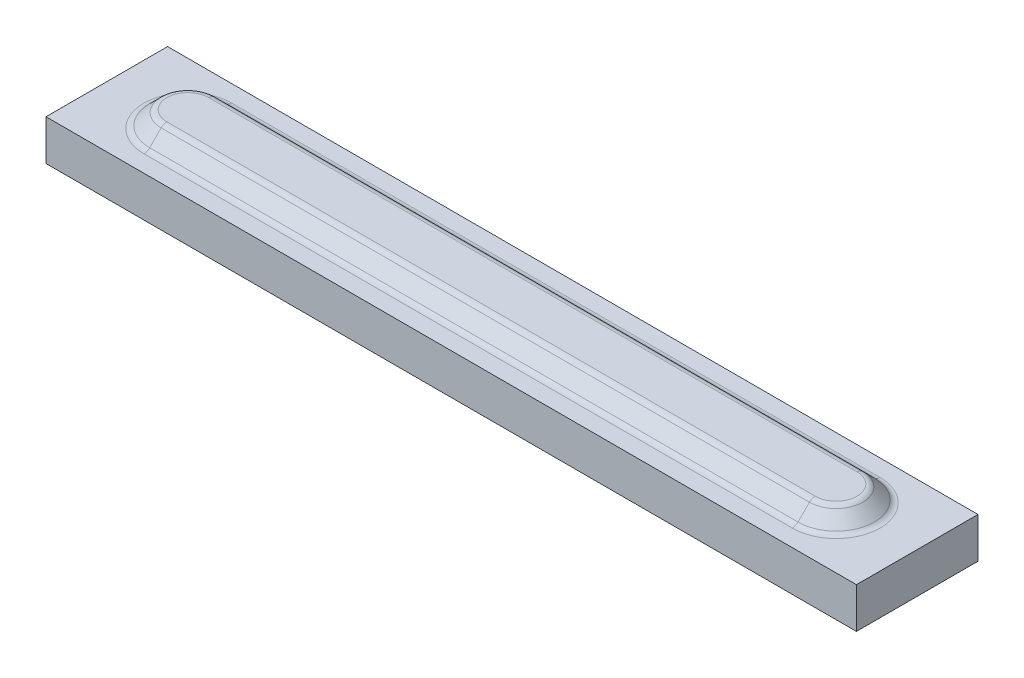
ISO-10303-21;
HEADER;
FILE_DESCRIPTION(('STEP AP214'),'2;1');
FILE_NAME('part.step','',(''),(''),'','','');
FILE_SCHEMA(('AUTOMOTIVE_DESIGN { 1 0 10303 214 1 1 1 1 }'));
ENDSEC;
DATA;
#1=APPLICATION_CONTEXT('core data for automotive mechanical design processes');
#2=APPLICATION_PROTOCOL_DEFINITION('international standard','automotive_design',2000,#1);
#3=PRODUCT_CONTEXT('',#1,'mechanical');
#4=PRODUCT('Part','Part','',(#3));
#5=PRODUCT_RELATED_PRODUCT_CATEGORY('part','',(#4));
#6=PRODUCT_DEFINITION_FORMATION('','',#4);
#7=PRODUCT_DEFINITION_CONTEXT('part definition',#1,'design');
#8=PRODUCT_DEFINITION('design','',#6,#7);
#9=PRODUCT_DEFINITION_SHAPE('','',#8);
#10=(LENGTH_UNIT() NAMED_UNIT(*) SI_UNIT(.MILLI.,.METRE.));
#11=(NAMED_UNIT(*) PLANE_ANGLE_UNIT() SI_UNIT($,.RADIAN.));
#12=(NAMED_UNIT(*) SI_UNIT($,.STERADIAN.) SOLID_ANGLE_UNIT());
#13=UNCERTAINTY_MEASURE_WITH_UNIT(LENGTH_MEASURE(1.E-05),#10,'distance_accuracy_value','');
#14=(GEOMETRIC_REPRESENTATION_CONTEXT(3) GLOBAL_UNCERTAINTY_ASSIGNED_CONTEXT((#13)) GLOBAL_UNIT_ASSIGNED_CONTEXT((#10,
#11,#12)) REPRESENTATION_CONTEXT('',''));
#15=CARTESIAN_POINT('',(0.,0.,0.));
#16=DIRECTION('',(0.,0.,1.));
#17=DIRECTION('',(1.,0.,0.));
#18=AXIS2_PLACEMENT_3D('',#15,#16,#17);
#19=CARTESIAN_POINT('',(0.,0.,9.99999999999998));
#20=DIRECTION('',(0.,0.707106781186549,0.707106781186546));
#21=DIRECTION('',(0.,-0.707106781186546,0.707106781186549));
#22=AXIS2_PLACEMENT_3D('',#19,#20,#21);
#23=PLANE('',#22);
#24=DIRECTION('',(0.,-0.707106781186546,0.707106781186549));
#25=VECTOR('',#24,1.);
#26=CARTESIAN_POINT('',(80.,0.,9.99999999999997));
#27=LINE('',#26,#25);
#28=CARTESIAN_POINT('',(80.,3.4142135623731,6.58578643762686));
#29=VERTEX_POINT('',#28);
#30=CARTESIAN_POINT('',(80.,0.585786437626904,9.41421356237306));
#31=VERTEX_POINT('',#30);
#32=EDGE_CURVE('E174',#29,#31,#27,.T.);
#33=ORIENTED_EDGE('',*,*,#32,.F.);
#34=DIRECTION('',(1.,0.,0.));
#35=VECTOR('',#34,1.);
#36=CARTESIAN_POINT('',(-80.,3.4142135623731,6.58578643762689));
#37=LINE('',#36,#35);
#38=CARTESIAN_POINT('',(-80.,3.4142135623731,6.58578643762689));
#39=VERTEX_POINT('',#38);
#40=EDGE_CURVE('E12',#29,#39,#37,.F.);
#41=ORIENTED_EDGE('',*,*,#40,.T.);
#42=DIRECTION('',(0.,-0.707106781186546,0.707106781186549));
#43=VECTOR('',#42,1.);
#44=CARTESIAN_POINT('',(-80.,0.,10.));
#45=LINE('',#44,#43);
#46=CARTESIAN_POINT('',(-80.,0.585786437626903,9.41421356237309));
#47=VERTEX_POINT('',#46);
#48=EDGE_CURVE('E170',#39,#47,#45,.T.);
#49=ORIENTED_EDGE('',*,*,#48,.T.);
#50=DIRECTION('',(1.,0.,0.));
#51=VECTOR('',#50,1.);
#52=CARTESIAN_POINT('',(0.,0.585786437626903,9.41421356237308));
#53=LINE('',#52,#51);
#54=EDGE_CURVE('E47',#47,#31,#53,.T.);
#55=ORIENTED_EDGE('',*,*,#54,.T.);
#56=EDGE_LOOP('',(#33,#41,#49,#55));
#57=FACE_BOUND('',#56,.T.);
#58=ADVANCED_FACE('F38',(#57),#23,.T.);
#59=CARTESIAN_POINT('',(80.,0.,0.));
#60=DIRECTION('',(0.,-1.,0.));
#61=DIRECTION('',(0.,0.,1.));
#62=AXIS2_PLACEMENT_3D('',#59,#60,#61);
#63=CONICAL_SURFACE('',#62,10.,0.78539816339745);
#64=DIRECTION('',(0.,-0.707106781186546,-0.707106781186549));
#65=VECTOR('',#64,1.);
#66=CARTESIAN_POINT('',(80.,0.,-10.));
#67=LINE('',#66,#65);
#68=CARTESIAN_POINT('',(80.,3.4142135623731,-6.58578643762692));
#69=VERTEX_POINT('',#68);
#70=CARTESIAN_POINT('',(80.,0.585786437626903,-9.41421356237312));
#71=VERTEX_POINT('',#70);
#72=EDGE_CURVE('E178',#69,#71,#67,.T.);
#73=ORIENTED_EDGE('',*,*,#72,.F.);
#74=CARTESIAN_POINT('',(80.,3.4142135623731,0.));
#75=DIRECTION('',(0.,-1.,0.));
#76=DIRECTION('',(0.,0.,-1.));
#77=AXIS2_PLACEMENT_3D('',#74,#75,#76);
#78=CIRCLE('',#77,6.58578643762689);
#79=EDGE_CURVE('E206',#69,#29,#78,.T.);
#80=ORIENTED_EDGE('',*,*,#79,.T.);
#81=ORIENTED_EDGE('',*,*,#32,.T.);
#82=CARTESIAN_POINT('',(80.,0.585786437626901,0.));
#83=DIRECTION('',(0.,1.,0.));
#84=DIRECTION('',(0.,0.,1.));
#85=AXIS2_PLACEMENT_3D('',#82,#83,#84);
#86=CIRCLE('',#85,9.4142135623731);
#87=EDGE_CURVE('E204',#31,#71,#86,.T.);
#88=ORIENTED_EDGE('',*,*,#87,.T.);
#89=EDGE_LOOP('',(#73,#80,#81,#88));
#90=FACE_BOUND('',#89,.T.);
#91=ADVANCED_FACE('F268',(#90),#63,.T.);
#92=CARTESIAN_POINT('',(0.,0.,-10.));
#93=DIRECTION('',(0.,0.707106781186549,-0.707106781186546));
#94=DIRECTION('',(0.,0.707106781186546,0.707106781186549));
#95=AXIS2_PLACEMENT_3D('',#92,#93,#94);
#96=PLANE('',#95);
#97=DIRECTION('',(0.,-0.707106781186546,-0.707106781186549));
#98=VECTOR('',#97,1.);
#99=CARTESIAN_POINT('',(-80.,0.,-10.));
#100=LINE('',#99,#98);
#101=CARTESIAN_POINT('',(-80.,3.4142135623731,-6.58578643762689));
#102=VERTEX_POINT('',#101);
#103=CARTESIAN_POINT('',(-80.,0.585786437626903,-9.4142135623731));
#104=VERTEX_POINT('',#103);
#105=EDGE_CURVE('E181',#102,#104,#100,.T.);
#106=ORIENTED_EDGE('',*,*,#105,.F.);
#107=DIRECTION('',(1.,0.,0.));
#108=VECTOR('',#107,1.);
#109=CARTESIAN_POINT('',(0.,3.4142135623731,-6.58578643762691));
#110=LINE('',#109,#108);
#111=EDGE_CURVE('E202',#102,#69,#110,.T.);
#112=ORIENTED_EDGE('',*,*,#111,.T.);
#113=ORIENTED_EDGE('',*,*,#72,.T.);
#114=DIRECTION('',(1.,0.,0.));
#115=VECTOR('',#114,1.);
#116=CARTESIAN_POINT('',(-80.,0.585786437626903,-9.4142135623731));
#117=LINE('',#116,#115);
#118=EDGE_CURVE('E200',#71,#104,#117,.F.);
#119=ORIENTED_EDGE('',*,*,#118,.T.);
#120=EDGE_LOOP('',(#106,#112,#113,#119));
#121=FACE_BOUND('',#120,.T.);
#122=ADVANCED_FACE('F264',(#121),#96,.T.);
#123=CARTESIAN_POINT('',(-80.,0.,0.));
#124=DIRECTION('',(0.,-1.,0.));
#125=DIRECTION('',(0.,0.,1.));
#126=AXIS2_PLACEMENT_3D('',#123,#124,#125);
#127=CONICAL_SURFACE('',#126,10.,0.78539816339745);
#128=ORIENTED_EDGE('',*,*,#48,.F.);
#129=CARTESIAN_POINT('',(-80.,3.4142135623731,0.));
#130=DIRECTION('',(0.,-1.,0.));
#131=DIRECTION('',(0.,0.,-1.));
#132=AXIS2_PLACEMENT_3D('',#129,#130,#131);
#133=CIRCLE('',#132,6.58578643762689);
#134=EDGE_CURVE('E197',#39,#102,#133,.T.);
#135=ORIENTED_EDGE('',*,*,#134,.T.);
#136=ORIENTED_EDGE('',*,*,#105,.T.);
#137=CARTESIAN_POINT('',(-80.,0.585786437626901,0.));
#138=DIRECTION('',(0.,1.,0.));
#139=DIRECTION('',(0.,0.,1.));
#140=AXIS2_PLACEMENT_3D('',#137,#138,#139);
#141=CIRCLE('',#140,9.4142135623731);
#142=EDGE_CURVE('E194',#104,#47,#141,.T.);
#143=ORIENTED_EDGE('',*,*,#142,.T.);
#144=EDGE_LOOP('',(#128,#135,#136,#143));
#145=FACE_BOUND('',#144,.T.);
#146=ADVANCED_FACE('F249',(#145),#127,.T.);
#147=CARTESIAN_POINT('',(0.,4.,0.));
#148=DIRECTION('',(0.,1.,0.));
#149=DIRECTION('',(0.,0.,1.));
#150=AXIS2_PLACEMENT_3D('',#147,#148,#149);
#151=PLANE('',#150);
#152=DIRECTION('',(1.,0.,0.));
#153=VECTOR('',#152,1.);
#154=CARTESIAN_POINT('',(0.,4.,-5.17157287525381));
#155=LINE('',#154,#153);
#156=CARTESIAN_POINT('',(80.,4.,-5.17157287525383));
#157=VERTEX_POINT('',#156);
#158=CARTESIAN_POINT('',(-80.,4.,-5.1715728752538));
#159=VERTEX_POINT('',#158);
#160=EDGE_CURVE('E189',#157,#159,#155,.F.);
#161=ORIENTED_EDGE('',*,*,#160,.T.);
#162=CARTESIAN_POINT('',(-80.,4.,0.));
#163=DIRECTION('',(0.,1.,0.));
#164=DIRECTION('',(0.,0.,1.));
#165=AXIS2_PLACEMENT_3D('',#162,#163,#164);
#166=CIRCLE('',#165,5.1715728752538);
#167=CARTESIAN_POINT('',(-80.,4.,5.1715728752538));
#168=VERTEX_POINT('',#167);
#169=EDGE_CURVE('E191',#159,#168,#166,.T.);
#170=ORIENTED_EDGE('',*,*,#169,.T.);
#171=DIRECTION('',(-1.,0.,0.));
#172=VECTOR('',#171,1.);
#173=CARTESIAN_POINT('',(80.,4.,5.17157287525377));
#174=LINE('',#173,#172);
#175=CARTESIAN_POINT('',(80.,4.,5.17157287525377));
#176=VERTEX_POINT('',#175);
#177=EDGE_CURVE('E177',#168,#176,#174,.F.);
#178=ORIENTED_EDGE('',*,*,#177,.T.);
#179=CARTESIAN_POINT('',(80.,4.,0.));
#180=DIRECTION('',(0.,1.,0.));
#181=DIRECTION('',(0.,0.,1.));
#182=AXIS2_PLACEMENT_3D('',#179,#180,#181);
#183=CIRCLE('',#182,5.1715728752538);
#184=EDGE_CURVE('E187',#176,#157,#183,.T.);
#185=ORIENTED_EDGE('',*,*,#184,.T.);
#186=EDGE_LOOP('',(#161,#170,#178,#185));
#187=FACE_BOUND('',#186,.T.);
#188=ADVANCED_FACE('F277',(#187),#151,.T.);
#189=CARTESIAN_POINT('',(0.,0.,0.));
#190=DIRECTION('',(0.,1.,0.));
#191=DIRECTION('',(0.,0.,1.));
#192=AXIS2_PLACEMENT_3D('',#189,#190,#191);
#193=PLANE('',#192);
#194=DIRECTION('',(-1.,0.,0.));
#195=VECTOR('',#194,1.);
#196=CARTESIAN_POINT('',(0.,0.,10.8284271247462));
#197=LINE('',#196,#195);
#198=CARTESIAN_POINT('',(80.,0.,10.8284271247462));
#199=VERTEX_POINT('',#198);
#200=CARTESIAN_POINT('',(-80.,0.,10.8284271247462));
#201=VERTEX_POINT('',#200);
#202=EDGE_CURVE('E208',#199,#201,#197,.T.);
#203=ORIENTED_EDGE('',*,*,#202,.T.);
#204=CARTESIAN_POINT('',(-80.,0.,0.));
#205=DIRECTION('',(0.,1.,0.));
#206=DIRECTION('',(0.,0.,1.));
#207=AXIS2_PLACEMENT_3D('',#204,#205,#206);
#208=CIRCLE('',#207,10.8284271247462);
#209=CARTESIAN_POINT('',(-80.,0.,-10.8284271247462));
#210=VERTEX_POINT('',#209);
#211=EDGE_CURVE('E213',#201,#210,#208,.F.);
#212=ORIENTED_EDGE('',*,*,#211,.T.);
#213=DIRECTION('',(1.,0.,0.));
#214=VECTOR('',#213,1.);
#215=CARTESIAN_POINT('',(80.,0.,-10.8284271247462));
#216=LINE('',#215,#214);
#217=CARTESIAN_POINT('',(80.,0.,-10.8284271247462));
#218=VERTEX_POINT('',#217);
#219=EDGE_CURVE('E62',#210,#218,#216,.T.);
#220=ORIENTED_EDGE('',*,*,#219,.T.);
#221=CARTESIAN_POINT('',(80.,0.,0.));
#222=DIRECTION('',(0.,1.,0.));
#223=DIRECTION('',(0.,0.,1.));
#224=AXIS2_PLACEMENT_3D('',#221,#222,#223);
#225=CIRCLE('',#224,10.8284271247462);
#226=EDGE_CURVE('E210',#218,#199,#225,.F.);
#227=ORIENTED_EDGE('',*,*,#226,.T.);
#228=EDGE_LOOP('',(#203,#212,#220,#227));
#229=FACE_BOUND('',#228,.T.);
#230=DIRECTION('',(0.,0.,1.));
#231=VECTOR('',#230,1.);
#232=CARTESIAN_POINT('',(100.,0.,0.));
#233=LINE('',#232,#231);
#234=CARTESIAN_POINT('',(100.,0.,-15.));
#235=VERTEX_POINT('',#234);
#236=CARTESIAN_POINT('',(100.,0.,15.));
#237=VERTEX_POINT('',#236);
#238=EDGE_CURVE('E163',#235,#237,#233,.T.);
#239=ORIENTED_EDGE('',*,*,#238,.F.);
#240=DIRECTION('',(1.,0.,0.));
#241=VECTOR('',#240,1.);
#242=CARTESIAN_POINT('',(0.,0.,-15.));
#243=LINE('',#242,#241);
#244=CARTESIAN_POINT('',(-100.,0.,-15.));
#245=VERTEX_POINT('',#244);
#246=EDGE_CURVE('E145',#245,#235,#243,.T.);
#247=ORIENTED_EDGE('',*,*,#246,.F.);
#248=DIRECTION('',(0.,0.,1.));
#249=VECTOR('',#248,1.);
#250=CARTESIAN_POINT('',(-100.,0.,0.));
#251=LINE('',#250,#249);
#252=CARTESIAN_POINT('',(-100.,0.,15.));
#253=VERTEX_POINT('',#252);
#254=EDGE_CURVE('E158',#245,#253,#251,.T.);
#255=ORIENTED_EDGE('',*,*,#254,.T.);
#256=DIRECTION('',(1.,0.,0.));
#257=VECTOR('',#256,1.);
#258=CARTESIAN_POINT('',(0.,0.,15.));
#259=LINE('',#258,#257);
#260=EDGE_CURVE('E155',#253,#237,#259,.T.);
#261=ORIENTED_EDGE('',*,*,#260,.T.);
#262=EDGE_LOOP('',(#239,#247,#255,#261));
#263=FACE_BOUND('',#262,.T.);
#264=ADVANCED_FACE('F240',(#229,#263),#193,.T.);
#265=CARTESIAN_POINT('',(100.,-10.,0.));
#266=DIRECTION('',(-1.,0.,0.));
#267=DIRECTION('',(0.,0.,1.));
#268=AXIS2_PLACEMENT_3D('',#265,#266,#267);
#269=PLANE('',#268);
#270=ORIENTED_EDGE('',*,*,#238,.T.);
#271=DIRECTION('',(0.,1.,0.));
#272=VECTOR('',#271,1.);
#273=CARTESIAN_POINT('',(100.,-10.,15.));
#274=LINE('',#273,#272);
#275=CARTESIAN_POINT('',(100.,-10.,15.));
#276=VERTEX_POINT('',#275);
#277=EDGE_CURVE('E153',#276,#237,#274,.T.);
#278=ORIENTED_EDGE('',*,*,#277,.F.);
#279=DIRECTION('',(0.,0.,1.));
#280=VECTOR('',#279,1.);
#281=CARTESIAN_POINT('',(100.,-10.,0.));
#282=LINE('',#281,#280);
#283=CARTESIAN_POINT('',(100.,-10.,-15.));
#284=VERTEX_POINT('',#283);
#285=EDGE_CURVE('E135',#284,#276,#282,.T.);
#286=ORIENTED_EDGE('',*,*,#285,.F.);
#287=DIRECTION('',(0.,1.,0.));
#288=VECTOR('',#287,1.);
#289=CARTESIAN_POINT('',(100.,-10.,-15.));
#290=LINE('',#289,#288);
#291=EDGE_CURVE('E142',#284,#235,#290,.T.);
#292=ORIENTED_EDGE('',*,*,#291,.T.);
#293=EDGE_LOOP('',(#270,#278,#286,#292));
#294=FACE_BOUND('',#293,.T.);
#295=ADVANCED_FACE('F152',(#294),#269,.F.);
#296=CARTESIAN_POINT('',(0.,-10.,15.));
#297=DIRECTION('',(0.,0.,1.));
#298=DIRECTION('',(1.,0.,0.));
#299=AXIS2_PLACEMENT_3D('',#296,#297,#298);
#300=PLANE('',#299);
#301=ORIENTED_EDGE('',*,*,#260,.F.);
#302=DIRECTION('',(0.,1.,0.));
#303=VECTOR('',#302,1.);
#304=CARTESIAN_POINT('',(-100.,-10.,15.));
#305=LINE('',#304,#303);
#306=CARTESIAN_POINT('',(-100.,-10.,15.));
#307=VERTEX_POINT('',#306);
#308=EDGE_CURVE('E171',#307,#253,#305,.T.);
#309=ORIENTED_EDGE('',*,*,#308,.F.);
#310=DIRECTION('',(1.,0.,0.));
#311=VECTOR('',#310,1.);
#312=CARTESIAN_POINT('',(0.,-10.,15.));
#313=LINE('',#312,#311);
#314=EDGE_CURVE('E150',#307,#276,#313,.T.);
#315=ORIENTED_EDGE('',*,*,#314,.T.);
#316=ORIENTED_EDGE('',*,*,#277,.T.);
#317=EDGE_LOOP('',(#301,#309,#315,#316));
#318=FACE_BOUND('',#317,.T.);
#319=ADVANCED_FACE('F348',(#318),#300,.T.);
#320=CARTESIAN_POINT('',(-100.,-10.,0.));
#321=DIRECTION('',(-1.,0.,0.));
#322=DIRECTION('',(0.,0.,1.));
#323=AXIS2_PLACEMENT_3D('',#320,#321,#322);
#324=PLANE('',#323);
#325=ORIENTED_EDGE('',*,*,#254,.F.);
#326=DIRECTION('',(0.,1.,0.));
#327=VECTOR('',#326,1.);
#328=CARTESIAN_POINT('',(-100.,-10.,-15.));
#329=LINE('',#328,#327);
#330=CARTESIAN_POINT('',(-100.,-10.,-15.));
#331=VERTEX_POINT('',#330);
#332=EDGE_CURVE('E149',#331,#245,#329,.T.);
#333=ORIENTED_EDGE('',*,*,#332,.F.);
#334=DIRECTION('',(0.,0.,1.));
#335=VECTOR('',#334,1.);
#336=CARTESIAN_POINT('',(-100.,-10.,0.));
#337=LINE('',#336,#335);
#338=EDGE_CURVE('E138',#331,#307,#337,.T.);
#339=ORIENTED_EDGE('',*,*,#338,.T.);
#340=ORIENTED_EDGE('',*,*,#308,.T.);
#341=EDGE_LOOP('',(#325,#333,#339,#340));
#342=FACE_BOUND('',#341,.T.);
#343=ADVANCED_FACE('F341',(#342),#324,.T.);
#344=CARTESIAN_POINT('',(0.,-10.,-15.));
#345=DIRECTION('',(0.,0.,1.));
#346=DIRECTION('',(1.,0.,0.));
#347=AXIS2_PLACEMENT_3D('',#344,#345,#346);
#348=PLANE('',#347);
#349=ORIENTED_EDGE('',*,*,#246,.T.);
#350=ORIENTED_EDGE('',*,*,#291,.F.);
#351=DIRECTION('',(1.,0.,0.));
#352=VECTOR('',#351,1.);
#353=CARTESIAN_POINT('',(0.,-10.,-15.));
#354=LINE('',#353,#352);
#355=EDGE_CURVE('E130',#331,#284,#354,.T.);
#356=ORIENTED_EDGE('',*,*,#355,.F.);
#357=ORIENTED_EDGE('',*,*,#332,.T.);
#358=EDGE_LOOP('',(#349,#350,#356,#357));
#359=FACE_BOUND('',#358,.T.);
#360=ADVANCED_FACE('F143',(#359),#348,.F.);
#361=CARTESIAN_POINT('',(0.,-10.,0.));
#362=DIRECTION('',(0.,1.,0.));
#363=DIRECTION('',(0.,0.,1.));
#364=AXIS2_PLACEMENT_3D('',#361,#362,#363);
#365=PLANE('',#364);
#366=ORIENTED_EDGE('',*,*,#285,.T.);
#367=ORIENTED_EDGE('',*,*,#314,.F.);
#368=ORIENTED_EDGE('',*,*,#338,.F.);
#369=ORIENTED_EDGE('',*,*,#355,.T.);
#370=EDGE_LOOP('',(#366,#367,#368,#369));
#371=FACE_BOUND('',#370,.T.);
#372=ADVANCED_FACE('F132',(#371),#365,.F.);
#373=CARTESIAN_POINT('',(80.,2.,0.));
#374=DIRECTION('',(0.,1.,0.));
#375=DIRECTION('',(0.,0.,1.));
#376=AXIS2_PLACEMENT_3D('',#373,#374,#375);
#377=TOROIDAL_SURFACE('',#376,5.1715728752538,2.);
#378=CARTESIAN_POINT('',(80.,2.,5.17157287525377));
#379=DIRECTION('',(-1.,0.,0.));
#380=DIRECTION('',(0.,0.,1.));
#381=AXIS2_PLACEMENT_3D('',#378,#379,#380);
#382=CIRCLE('',#381,2.);
#383=EDGE_CURVE('E220',#29,#176,#382,.T.);
#384=ORIENTED_EDGE('',*,*,#383,.F.);
#385=ORIENTED_EDGE('',*,*,#79,.F.);
#386=CARTESIAN_POINT('',(80.,2.,-5.17157287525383));
#387=DIRECTION('',(-1.,0.,0.));
#388=DIRECTION('',(0.,0.,1.));
#389=AXIS2_PLACEMENT_3D('',#386,#387,#388);
#390=CIRCLE('',#389,2.);
#391=EDGE_CURVE('E165',#157,#69,#390,.T.);
#392=ORIENTED_EDGE('',*,*,#391,.F.);
#393=ORIENTED_EDGE('',*,*,#184,.F.);
#394=EDGE_LOOP('',(#384,#385,#392,#393));
#395=FACE_BOUND('',#394,.T.);
#396=ADVANCED_FACE('F271',(#395),#377,.T.);
#397=CARTESIAN_POINT('',(0.,2.,-5.17157287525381));
#398=DIRECTION('',(1.,0.,0.));
#399=DIRECTION('',(0.,0.,-1.));
#400=AXIS2_PLACEMENT_3D('',#397,#398,#399);
#401=CYLINDRICAL_SURFACE('',#400,2.);
#402=ORIENTED_EDGE('',*,*,#391,.T.);
#403=ORIENTED_EDGE('',*,*,#111,.F.);
#404=CARTESIAN_POINT('',(-80.,2.,-5.1715728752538));
#405=DIRECTION('',(-1.,0.,0.));
#406=DIRECTION('',(0.,0.,1.));
#407=AXIS2_PLACEMENT_3D('',#404,#405,#406);
#408=CIRCLE('',#407,2.);
#409=EDGE_CURVE('E218',#159,#102,#408,.T.);
#410=ORIENTED_EDGE('',*,*,#409,.F.);
#411=ORIENTED_EDGE('',*,*,#160,.F.);
#412=EDGE_LOOP('',(#402,#403,#410,#411));
#413=FACE_BOUND('',#412,.T.);
#414=ADVANCED_FACE('F275',(#413),#401,.T.);
#415=CARTESIAN_POINT('',(0.,2.,5.17157287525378));
#416=DIRECTION('',(1.,0.,0.));
#417=DIRECTION('',(0.,0.,-1.));
#418=AXIS2_PLACEMENT_3D('',#415,#416,#417);
#419=CYLINDRICAL_SURFACE('',#418,2.);
#420=ORIENTED_EDGE('',*,*,#383,.T.);
#421=ORIENTED_EDGE('',*,*,#177,.F.);
#422=CARTESIAN_POINT('',(-80.,2.,5.1715728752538));
#423=DIRECTION('',(-1.,0.,0.));
#424=DIRECTION('',(0.,0.,1.));
#425=AXIS2_PLACEMENT_3D('',#422,#423,#424);
#426=CIRCLE('',#425,2.);
#427=EDGE_CURVE('E216',#39,#168,#426,.T.);
#428=ORIENTED_EDGE('',*,*,#427,.F.);
#429=ORIENTED_EDGE('',*,*,#40,.F.);
#430=EDGE_LOOP('',(#420,#421,#428,#429));
#431=FACE_BOUND('',#430,.T.);
#432=ADVANCED_FACE('F256',(#431),#419,.T.);
#433=CARTESIAN_POINT('',(-80.,2.,0.));
#434=DIRECTION('',(0.,1.,0.));
#435=DIRECTION('',(0.,0.,1.));
#436=AXIS2_PLACEMENT_3D('',#433,#434,#435);
#437=TOROIDAL_SURFACE('',#436,5.1715728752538,2.);
#438=ORIENTED_EDGE('',*,*,#409,.T.);
#439=ORIENTED_EDGE('',*,*,#134,.F.);
#440=ORIENTED_EDGE('',*,*,#427,.T.);
#441=ORIENTED_EDGE('',*,*,#169,.F.);
#442=EDGE_LOOP('',(#438,#439,#440,#441));
#443=FACE_BOUND('',#442,.T.);
#444=ADVANCED_FACE('F260',(#443),#437,.T.);
#445=CARTESIAN_POINT('',(80.,2.,0.));
#446=DIRECTION('',(0.,1.,0.));
#447=DIRECTION('',(0.,0.,1.));
#448=AXIS2_PLACEMENT_3D('',#445,#446,#447);
#449=TOROIDAL_SURFACE('',#448,10.8284271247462,2.);
#450=CARTESIAN_POINT('',(80.,2.,10.8284271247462));
#451=DIRECTION('',(1.,0.,0.));
#452=DIRECTION('',(0.,0.,-1.));
#453=AXIS2_PLACEMENT_3D('',#450,#451,#452);
#454=CIRCLE('',#453,2.);
#455=EDGE_CURVE('E227',#199,#31,#454,.T.);
#456=ORIENTED_EDGE('',*,*,#455,.F.);
#457=ORIENTED_EDGE('',*,*,#226,.F.);
#458=CARTESIAN_POINT('',(80.,2.,-10.8284271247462));
#459=DIRECTION('',(1.,0.,0.));
#460=DIRECTION('',(0.,0.,-1.));
#461=AXIS2_PLACEMENT_3D('',#458,#459,#460);
#462=CIRCLE('',#461,2.);
#463=EDGE_CURVE('E42',#71,#218,#462,.T.);
#464=ORIENTED_EDGE('',*,*,#463,.F.);
#465=ORIENTED_EDGE('',*,*,#87,.F.);
#466=EDGE_LOOP('',(#456,#457,#464,#465));
#467=FACE_BOUND('',#466,.T.);
#468=ADVANCED_FACE('F40',(#467),#449,.F.);
#469=CARTESIAN_POINT('',(0.,2.,-10.8284271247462));
#470=DIRECTION('',(-1.,0.,0.));
#471=DIRECTION('',(0.,0.,1.));
#472=AXIS2_PLACEMENT_3D('',#469,#470,#471);
#473=CYLINDRICAL_SURFACE('',#472,2.);
#474=ORIENTED_EDGE('',*,*,#463,.T.);
#475=ORIENTED_EDGE('',*,*,#219,.F.);
#476=CARTESIAN_POINT('',(-80.,2.,-10.8284271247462));
#477=DIRECTION('',(1.,0.,0.));
#478=DIRECTION('',(0.,0.,-1.));
#479=AXIS2_PLACEMENT_3D('',#476,#477,#478);
#480=CIRCLE('',#479,2.);
#481=EDGE_CURVE('E55',#104,#210,#480,.T.);
#482=ORIENTED_EDGE('',*,*,#481,.F.);
#483=ORIENTED_EDGE('',*,*,#118,.F.);
#484=EDGE_LOOP('',(#474,#475,#482,#483));
#485=FACE_BOUND('',#484,.T.);
#486=ADVANCED_FACE('F237',(#485),#473,.F.);
#487=CARTESIAN_POINT('',(0.,2.,10.8284271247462));
#488=DIRECTION('',(-1.,0.,0.));
#489=DIRECTION('',(0.,0.,1.));
#490=AXIS2_PLACEMENT_3D('',#487,#488,#489);
#491=CYLINDRICAL_SURFACE('',#490,2.);
#492=ORIENTED_EDGE('',*,*,#455,.T.);
#493=ORIENTED_EDGE('',*,*,#54,.F.);
#494=CARTESIAN_POINT('',(-80.,2.,10.8284271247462));
#495=DIRECTION('',(1.,0.,0.));
#496=DIRECTION('',(0.,0.,-1.));
#497=AXIS2_PLACEMENT_3D('',#494,#495,#496);
#498=CIRCLE('',#497,2.);
#499=EDGE_CURVE('E225',#201,#47,#498,.T.);
#500=ORIENTED_EDGE('',*,*,#499,.F.);
#501=ORIENTED_EDGE('',*,*,#202,.F.);
#502=EDGE_LOOP('',(#492,#493,#500,#501));
#503=FACE_BOUND('',#502,.T.);
#504=ADVANCED_FACE('F244',(#503),#491,.F.);
#505=CARTESIAN_POINT('',(-80.,2.,0.));
#506=DIRECTION('',(0.,1.,0.));
#507=DIRECTION('',(0.,0.,1.));
#508=AXIS2_PLACEMENT_3D('',#505,#506,#507);
#509=TOROIDAL_SURFACE('',#508,10.8284271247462,2.);
#510=ORIENTED_EDGE('',*,*,#481,.T.);
#511=ORIENTED_EDGE('',*,*,#211,.F.);
#512=ORIENTED_EDGE('',*,*,#499,.T.);
#513=ORIENTED_EDGE('',*,*,#142,.F.);
#514=EDGE_LOOP('',(#510,#511,#512,#513));
#515=FACE_BOUND('',#514,.T.);
#516=ADVANCED_FACE('F243',(#515),#509,.F.);
#517=CLOSED_SHELL('',(#58,#91,#122,#146,#188,#264,#295,#319,#343,#360,#372,#396,#414,#432,#444,
#468,#486,#504,#516));
#518=MANIFOLD_SOLID_BREP('B2',#517);
#519=ADVANCED_BREP_SHAPE_REPRESENTATION('',(#18,#518),#14);
#520=SHAPE_DEFINITION_REPRESENTATION(#9,#519);
ENDSEC;
END-ISO-10303-21;
